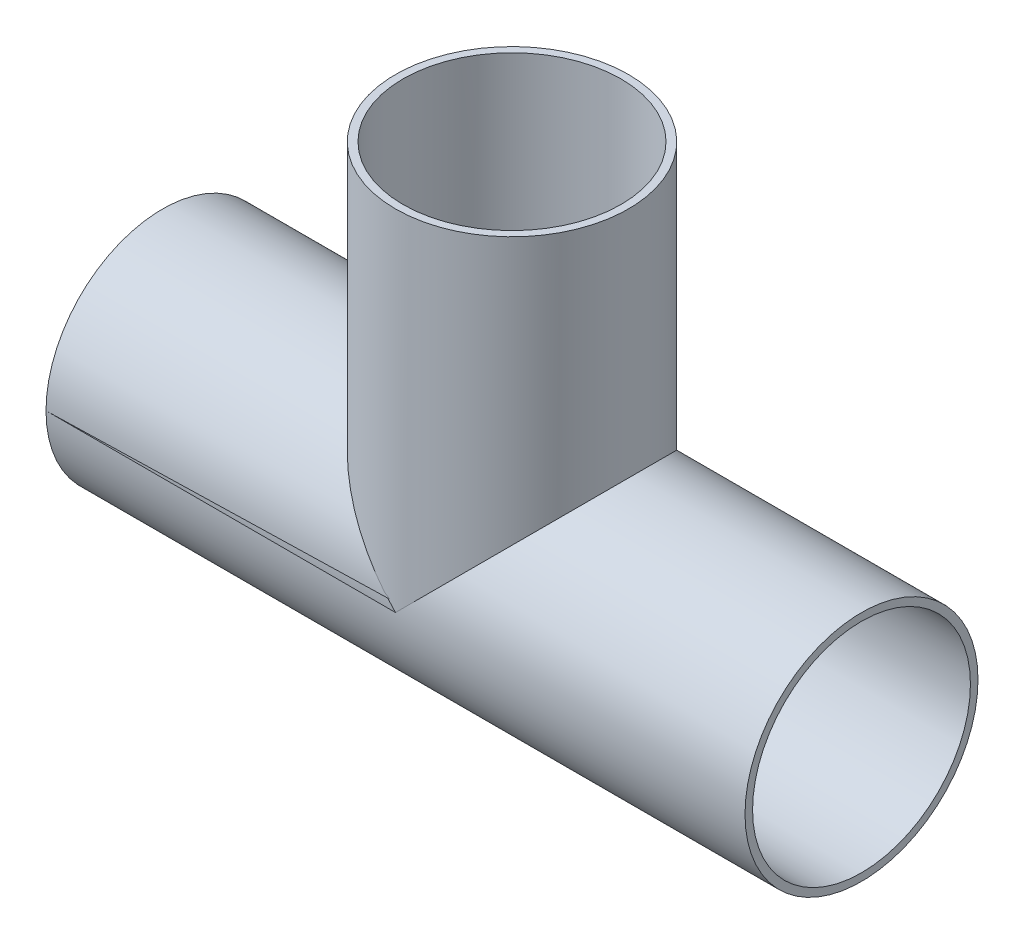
from build123d import *

# Parameters (mm, degrees)
SKETCH1_R           = 25.4
BOSS_EXTRUDE1_DEPTH = 76.2
SKETCH2_R           = 25.4
BOSS_EXTRUDE2_DEPTH = 76.2
SKETCH3_R           = 23.749
CUT_EXTRUDE1_DEPTH  = 76.2
SKETCH4_R           = 23.749
CUT_EXTRUDE2_DEPTH  = 173.271181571


with BuildPart() as part:
    # Sketch1 → Boss-Extrude1 (new body)
    with BuildSketch(Plane(origin=(0, 0, 0), x_dir=(1, 0, 0), z_dir=(0, 1, 0))):
        with Locations(Location((0, 0, 0), (0, 0, 90))):
            Circle(SKETCH1_R)
    extrude(amount=BOSS_EXTRUDE1_DEPTH)

    # Sketch2 → Boss-Extrude2 (add, symmetric)
    with BuildSketch(Plane(origin=(0, 0, 0), x_dir=(0, 0, -1), z_dir=(1, 0, 0))):
        Circle(SKETCH2_R)
    extrude(amount=BOSS_EXTRUDE2_DEPTH, both=True)

    # Sketch3 → Cut-Extrude1 (cut)
    with BuildSketch(Plane(origin=(0, 76.2, 0), x_dir=(1, 0, 0), z_dir=(0, 1, 0))):
        with Locations(Location((0, 0, 0), (0, 0, 270))):
            Circle(SKETCH3_R)
    extrude(amount=-CUT_EXTRUDE1_DEPTH, mode=Mode.SUBTRACT)

    # Sketch4 → Cut-Extrude2 (cut, through all)
    with BuildSketch(Plane(origin=(76.2, 0, 0), x_dir=(0, 0, -1), z_dir=(1, 0, 0))):
        Circle(SKETCH4_R)
    extrude(amount=-CUT_EXTRUDE2_DEPTH, mode=Mode.SUBTRACT)


solid = part.part
